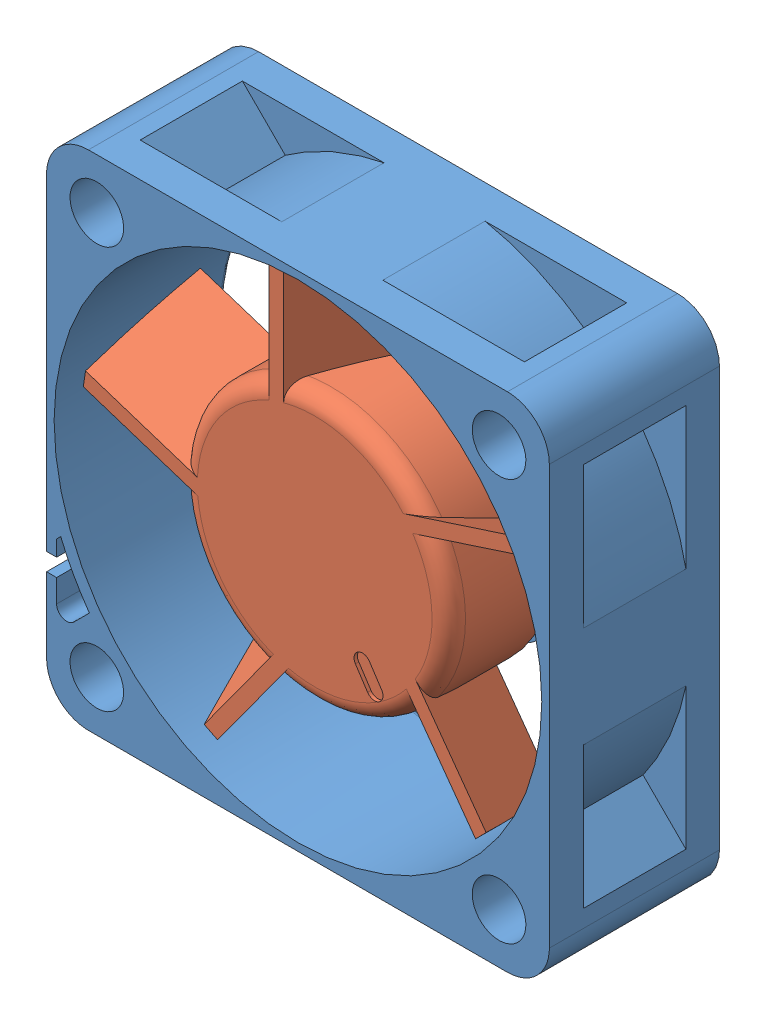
SolidWorks assembly COPAL F310R 30x30x10.sldasm, configuration Défaut (file format 7000). Lengths in mm.
Overall size (30.1 30.01 10.42).
2 component instances, 2 part files, 0 mates.
Components (placement in the parent):
- 410020030002-1: 410020030002.sldprt [Défaut] at origin size (30.1 30.01 10.42)
- PRT0001-1: PRT0001.sldprt [Défaut] at (0 0 -0.95) x (-1 0 0) z (0 0 -1) size (27.27 26.54 6.18)
